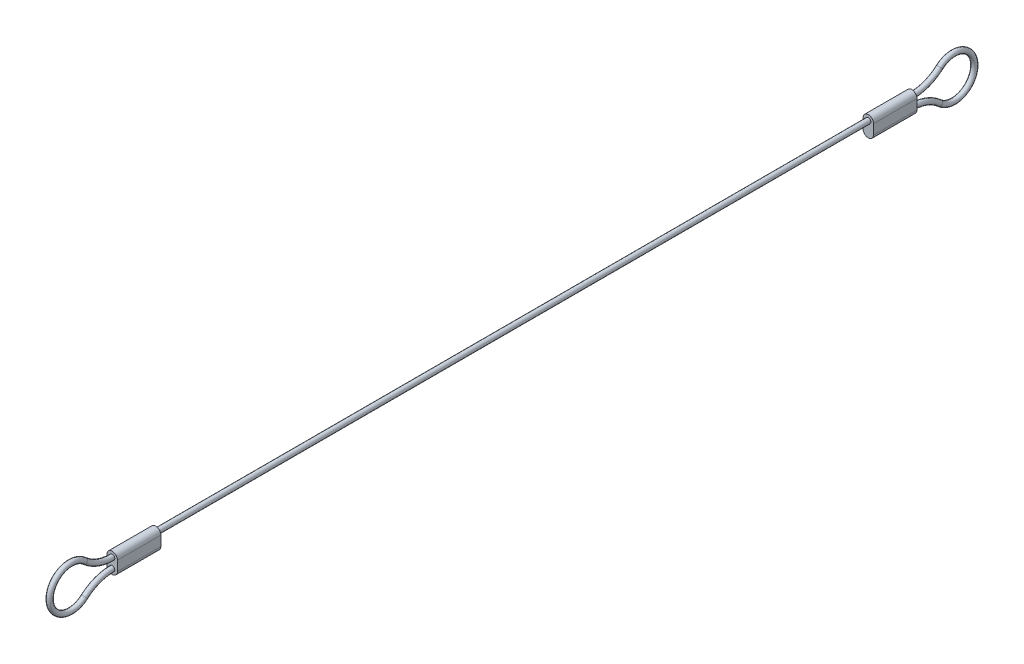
from build123d import *

# Parameters (mm, degrees)
SKETCH2_R           = 0.595
BOSS_EXTRUDE1_DEPTH = 10


with BuildPart() as part:
    # Sweep1: sweep along a path in Sketch1
    with BuildLine(Plane(origin=(0, 0, 0), x_dir=(0, 0, -1), z_dir=(1, 0, 0))) as sweep1_path:
        ThreePointArc((-92, -2.266252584), (-95.425492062, -2.898197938), (-98.4, -4.710835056))
        ThreePointArc((-98.4, -4.710835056), (-106.4, -1.133126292), (-98.4, 2.444582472))
        ThreePointArc((-98.4, 2.444582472), (-95.425492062, 0.631945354), (-92, 0))
        Line((-92, 0), (92, 0))
        ThreePointArc((92, 0), (95.425492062, 0.631945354), (98.4, 2.444582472))
        ThreePointArc((98.4, 2.444582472), (106.4, -1.133126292), (98.4, -4.710835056))
        ThreePointArc((98.4, -4.710835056), (95.425492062, -2.898197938), (92, -2.266252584))
    # Sketch2 → Sweep1 (sweep)
    with BuildSketch(Plane.XY):
        Circle(SKETCH2_R)
    sweep(path=sweep1_path.line)

    # Sketch3 → Boss-Extrude1 (add)
    with BuildSketch(Plane(origin=(0, 0, 92), x_dir=(-1, 0, 0), z_dir=(0, 0, -1))):
        with BuildLine():
            Line((1.2, 0), (1.2, -2.266252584))
            ThreePointArc((1.2, -2.266252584), (0, -3.466252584), (-1.2, -2.266252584))
            Line((-1.2, -2.266252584), (-1.2, 0))
            ThreePointArc((-1.2, 0), (0, 1.2), (1.2, 0))
        make_face()
    boss_extrude1 = extrude(amount=BOSS_EXTRUDE1_DEPTH)

    # Mirror1: Boss-Extrude1 across plane
    add(boss_extrude1.mirror(Plane.XY))


solid = part.part
